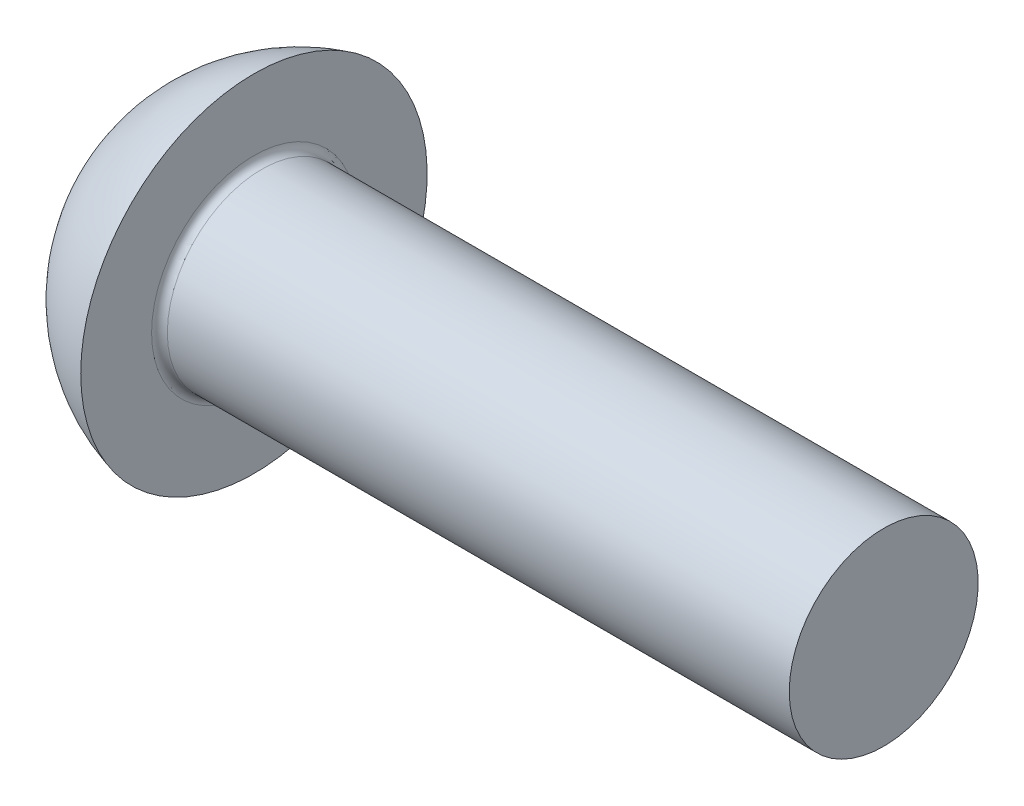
from build123d import *

# Parameters (mm, degrees)
FILLET1_R = 0.5


with BuildPart() as part:
    # Sketch1 → Base-Revolve (revolve)
    with BuildSketch(Plane(origin=(29.283515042, 18.283515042, 0), x_dir=(0, 1, 0), z_dir=(0, 0, 1))):
        with BuildLine():
            Line((-18.283515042, -19.216484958), (-18.283515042, 29.283515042))
            ThreePointArc((-18.283515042, 29.283515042), (-11.332795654, 26.910916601), (-7.283515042, 20.783515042))
            Line((-7.283515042, 20.783515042), (-12.283515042, 20.783515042))
            Line((-12.283515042, 20.783515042), (-12.283515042, -19.216484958))
            Line((-12.283515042, -19.216484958), (-18.283515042, -19.216484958))
        make_face()
    revolve(axis=Axis((42.010305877, 0, 0), (1, 0, 0)))

    # Fillet1
    fillet1_edges = [part.edges().sort_by_distance(p)[0] for p in [
        (8.5, -6, 0),
    ]]
    fillet(fillet1_edges, radius=FILLET1_R)


solid = part.part
